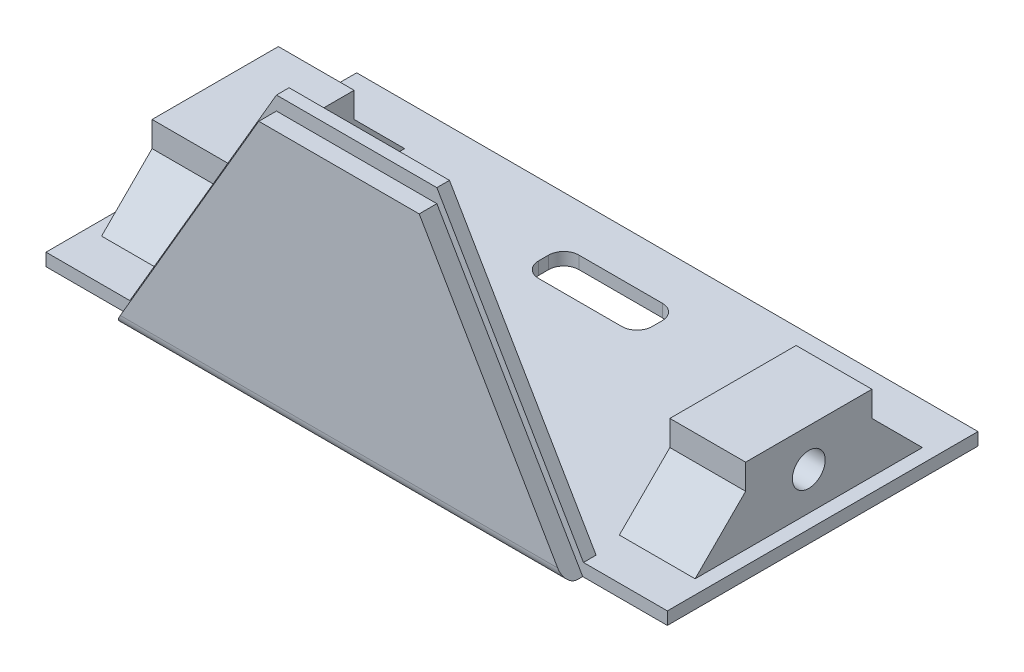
ISO-10303-21;
HEADER;
FILE_DESCRIPTION(('STEP AP214'),'2;1');
FILE_NAME('part.step','',(''),(''),'','','');
FILE_SCHEMA(('AUTOMOTIVE_DESIGN { 1 0 10303 214 1 1 1 1 }'));
ENDSEC;
DATA;
#1=APPLICATION_CONTEXT('core data for automotive mechanical design processes');
#2=APPLICATION_PROTOCOL_DEFINITION('international standard','automotive_design',2000,#1);
#3=PRODUCT_CONTEXT('',#1,'mechanical');
#4=PRODUCT('Part','Part','',(#3));
#5=PRODUCT_RELATED_PRODUCT_CATEGORY('part','',(#4));
#6=PRODUCT_DEFINITION_FORMATION('','',#4);
#7=PRODUCT_DEFINITION_CONTEXT('part definition',#1,'design');
#8=PRODUCT_DEFINITION('design','',#6,#7);
#9=PRODUCT_DEFINITION_SHAPE('','',#8);
#10=(LENGTH_UNIT() NAMED_UNIT(*) SI_UNIT(.MILLI.,.METRE.));
#11=(NAMED_UNIT(*) PLANE_ANGLE_UNIT() SI_UNIT($,.RADIAN.));
#12=(NAMED_UNIT(*) SI_UNIT($,.STERADIAN.) SOLID_ANGLE_UNIT());
#13=UNCERTAINTY_MEASURE_WITH_UNIT(LENGTH_MEASURE(1.E-05),#10,'distance_accuracy_value','');
#14=(GEOMETRIC_REPRESENTATION_CONTEXT(3) GLOBAL_UNCERTAINTY_ASSIGNED_CONTEXT((#13)) GLOBAL_UNIT_ASSIGNED_CONTEXT((#10,
#11,#12)) REPRESENTATION_CONTEXT('',''));
#15=CARTESIAN_POINT('',(0.,0.,0.));
#16=DIRECTION('',(0.,0.,1.));
#17=DIRECTION('',(1.,0.,0.));
#18=AXIS2_PLACEMENT_3D('',#15,#16,#17);
#19=CARTESIAN_POINT('',(0.,1.,0.));
#20=DIRECTION('',(0.,-1.,0.));
#21=DIRECTION('',(0.,0.,-1.));
#22=AXIS2_PLACEMENT_3D('',#19,#20,#21);
#23=PLANE('',#22);
#24=DIRECTION('',(-1.,0.,0.));
#25=VECTOR('',#24,1.);
#26=CARTESIAN_POINT('',(3.3,1.,-8.6));
#27=LINE('',#26,#25);
#28=CARTESIAN_POINT('',(3.3,1.,-8.6));
#29=VERTEX_POINT('',#28);
#30=CARTESIAN_POINT('',(-3.3,1.,-8.6));
#31=VERTEX_POINT('',#30);
#32=EDGE_CURVE('E1223',#29,#31,#27,.T.);
#33=ORIENTED_EDGE('',*,*,#32,.F.);
#34=CARTESIAN_POINT('',(3.3,1.,-7.4));
#35=DIRECTION('',(0.,-1.,0.));
#36=DIRECTION('',(0.,0.,-1.));
#37=AXIS2_PLACEMENT_3D('',#34,#35,#36);
#38=CIRCLE('',#37,1.2);
#39=CARTESIAN_POINT('',(4.5,1.,-7.4));
#40=VERTEX_POINT('',#39);
#41=EDGE_CURVE('E341',#40,#29,#38,.F.);
#42=ORIENTED_EDGE('',*,*,#41,.F.);
#43=DIRECTION('',(0.,0.,-1.));
#44=VECTOR('',#43,1.);
#45=CARTESIAN_POINT('',(4.5,1.,-6.6));
#46=LINE('',#45,#44);
#47=CARTESIAN_POINT('',(4.5,1.,-6.6));
#48=VERTEX_POINT('',#47);
#49=EDGE_CURVE('E338',#48,#40,#46,.T.);
#50=ORIENTED_EDGE('',*,*,#49,.F.);
#51=CARTESIAN_POINT('',(3.3,1.,-6.6));
#52=DIRECTION('',(0.,-1.,0.));
#53=DIRECTION('',(0.,0.,-1.));
#54=AXIS2_PLACEMENT_3D('',#51,#52,#53);
#55=CIRCLE('',#54,1.2);
#56=CARTESIAN_POINT('',(3.3,1.,-5.4));
#57=VERTEX_POINT('',#56);
#58=EDGE_CURVE('E295',#57,#48,#55,.F.);
#59=ORIENTED_EDGE('',*,*,#58,.F.);
#60=DIRECTION('',(1.,0.,0.));
#61=VECTOR('',#60,1.);
#62=CARTESIAN_POINT('',(3.3,1.,-5.4));
#63=LINE('',#62,#61);
#64=CARTESIAN_POINT('',(-3.3,1.,-5.4));
#65=VERTEX_POINT('',#64);
#66=EDGE_CURVE('E1211',#65,#57,#63,.T.);
#67=ORIENTED_EDGE('',*,*,#66,.F.);
#68=CARTESIAN_POINT('',(-3.3,1.,-6.6));
#69=DIRECTION('',(0.,-1.,0.));
#70=DIRECTION('',(0.,0.,-1.));
#71=AXIS2_PLACEMENT_3D('',#68,#69,#70);
#72=CIRCLE('',#71,1.2);
#73=CARTESIAN_POINT('',(-4.5,1.,-6.6));
#74=VERTEX_POINT('',#73);
#75=EDGE_CURVE('E1213',#74,#65,#72,.F.);
#76=ORIENTED_EDGE('',*,*,#75,.F.);
#77=DIRECTION('',(0.,0.,1.));
#78=VECTOR('',#77,1.);
#79=CARTESIAN_POINT('',(-4.5,1.,-6.6));
#80=LINE('',#79,#78);
#81=CARTESIAN_POINT('',(-4.5,1.,-7.4));
#82=VERTEX_POINT('',#81);
#83=EDGE_CURVE('E1219',#82,#74,#80,.T.);
#84=ORIENTED_EDGE('',*,*,#83,.F.);
#85=CARTESIAN_POINT('',(-3.3,1.,-7.4));
#86=DIRECTION('',(0.,-1.,0.));
#87=DIRECTION('',(0.,0.,-1.));
#88=AXIS2_PLACEMENT_3D('',#85,#86,#87);
#89=CIRCLE('',#88,1.2);
#90=EDGE_CURVE('E1221',#31,#82,#89,.F.);
#91=ORIENTED_EDGE('',*,*,#90,.F.);
#92=EDGE_LOOP('',(#33,#42,#50,#59,#67,#76,#84,#91));
#93=FACE_BOUND('',#92,.T.);
#94=DIRECTION('',(1.,0.,0.));
#95=VECTOR('',#94,1.);
#96=CARTESIAN_POINT('',(0.,1.,-8.99999999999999));
#97=LINE('',#96,#95);
#98=CARTESIAN_POINT('',(17.5,1.,-8.99999999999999));
#99=VERTEX_POINT('',#98);
#100=CARTESIAN_POINT('',(23.5,1.,-8.99999999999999));
#101=VERTEX_POINT('',#100);
#102=EDGE_CURVE('E560',#99,#101,#97,.T.);
#103=ORIENTED_EDGE('',*,*,#102,.T.);
#104=DIRECTION('',(0.,0.,1.));
#105=VECTOR('',#104,1.);
#106=CARTESIAN_POINT('',(23.5,1.,-5.));
#107=LINE('',#106,#105);
#108=CARTESIAN_POINT('',(23.5,1.,8.99999999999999));
#109=VERTEX_POINT('',#108);
#110=EDGE_CURVE('E347',#101,#109,#107,.T.);
#111=ORIENTED_EDGE('',*,*,#110,.T.);
#112=DIRECTION('',(-1.,0.,0.));
#113=VECTOR('',#112,1.);
#114=CARTESIAN_POINT('',(0.,1.,8.99999999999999));
#115=LINE('',#114,#113);
#116=CARTESIAN_POINT('',(17.5,1.,8.99999999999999));
#117=VERTEX_POINT('',#116);
#118=EDGE_CURVE('E557',#109,#117,#115,.T.);
#119=ORIENTED_EDGE('',*,*,#118,.T.);
#120=DIRECTION('',(0.,0.,-1.));
#121=VECTOR('',#120,1.);
#122=CARTESIAN_POINT('',(17.5,1.,-5.));
#123=LINE('',#122,#121);
#124=EDGE_CURVE('E352',#117,#99,#123,.T.);
#125=ORIENTED_EDGE('',*,*,#124,.T.);
#126=EDGE_LOOP('',(#103,#111,#119,#125));
#127=FACE_BOUND('',#126,.T.);
#128=DIRECTION('',(-1.,0.,0.));
#129=VECTOR('',#128,1.);
#130=CARTESIAN_POINT('',(-4.5,1.,6.3));
#131=LINE('',#130,#129);
#132=CARTESIAN_POINT('',(-4.5,1.,6.3));
#133=VERTEX_POINT('',#132);
#134=CARTESIAN_POINT('',(-5.5,1.,6.3));
#135=VERTEX_POINT('',#134);
#136=EDGE_CURVE('E423',#133,#135,#131,.T.);
#137=ORIENTED_EDGE('',*,*,#136,.F.);
#138=DIRECTION('',(0.,0.,-1.));
#139=VECTOR('',#138,1.);
#140=CARTESIAN_POINT('',(-4.5,1.,11.3));
#141=LINE('',#140,#139);
#142=CARTESIAN_POINT('',(-4.5,1.,11.3));
#143=VERTEX_POINT('',#142);
#144=EDGE_CURVE('E415',#143,#133,#141,.T.);
#145=ORIENTED_EDGE('',*,*,#144,.F.);
#146=DIRECTION('',(-1.,0.,0.));
#147=VECTOR('',#146,1.);
#148=CARTESIAN_POINT('',(-17.9583333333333,1.,11.3));
#149=LINE('',#148,#147);
#150=CARTESIAN_POINT('',(4.5,1.,11.3));
#151=VERTEX_POINT('',#150);
#152=EDGE_CURVE('E457',#151,#143,#149,.T.);
#153=ORIENTED_EDGE('',*,*,#152,.F.);
#154=DIRECTION('',(0.,0.,-1.));
#155=VECTOR('',#154,1.);
#156=CARTESIAN_POINT('',(4.5,1.,11.3));
#157=LINE('',#156,#155);
#158=CARTESIAN_POINT('',(4.5,1.,6.3));
#159=VERTEX_POINT('',#158);
#160=EDGE_CURVE('E434',#151,#159,#157,.T.);
#161=ORIENTED_EDGE('',*,*,#160,.T.);
#162=DIRECTION('',(1.,0.,0.));
#163=VECTOR('',#162,1.);
#164=CARTESIAN_POINT('',(4.5,1.,6.3));
#165=LINE('',#164,#163);
#166=CARTESIAN_POINT('',(5.5,1.,6.3));
#167=VERTEX_POINT('',#166);
#168=EDGE_CURVE('E442',#159,#167,#165,.T.);
#169=ORIENTED_EDGE('',*,*,#168,.T.);
#170=DIRECTION('',(0.,0.,-1.));
#171=VECTOR('',#170,1.);
#172=CARTESIAN_POINT('',(5.5,1.,11.3));
#173=LINE('',#172,#171);
#174=CARTESIAN_POINT('',(5.5,1.,11.3));
#175=VERTEX_POINT('',#174);
#176=EDGE_CURVE('E425',#175,#167,#173,.T.);
#177=ORIENTED_EDGE('',*,*,#176,.F.);
#178=CARTESIAN_POINT('',(17.9583333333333,1.,11.3));
#179=VERTEX_POINT('',#178);
#180=EDGE_CURVE('E453',#179,#175,#149,.T.);
#181=ORIENTED_EDGE('',*,*,#180,.F.);
#182=DIRECTION('',(0.,0.,1.));
#183=VECTOR('',#182,1.);
#184=CARTESIAN_POINT('',(17.9583333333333,1.,11.3));
#185=LINE('',#184,#183);
#186=CARTESIAN_POINT('',(17.9583333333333,1.,12.3));
#187=VERTEX_POINT('',#186);
#188=EDGE_CURVE('E473',#179,#187,#185,.T.);
#189=ORIENTED_EDGE('',*,*,#188,.T.);
#190=DIRECTION('',(1.,0.,0.));
#191=VECTOR('',#190,1.);
#192=CARTESIAN_POINT('',(24.6,1.,12.3));
#193=LINE('',#192,#191);
#194=CARTESIAN_POINT('',(24.6,1.,12.3));
#195=VERTEX_POINT('',#194);
#196=EDGE_CURVE('E507',#187,#195,#193,.T.);
#197=ORIENTED_EDGE('',*,*,#196,.T.);
#198=DIRECTION('',(0.,0.,-1.));
#199=VECTOR('',#198,1.);
#200=CARTESIAN_POINT('',(24.6,1.,-12.3));
#201=LINE('',#200,#199);
#202=CARTESIAN_POINT('',(24.6,1.,-12.3));
#203=VERTEX_POINT('',#202);
#204=EDGE_CURVE('E512',#195,#203,#201,.T.);
#205=ORIENTED_EDGE('',*,*,#204,.T.);
#206=DIRECTION('',(-1.,0.,0.));
#207=VECTOR('',#206,1.);
#208=CARTESIAN_POINT('',(24.6,1.,-12.3));
#209=LINE('',#208,#207);
#210=CARTESIAN_POINT('',(-24.6,1.,-12.3));
#211=VERTEX_POINT('',#210);
#212=EDGE_CURVE('E514',#203,#211,#209,.T.);
#213=ORIENTED_EDGE('',*,*,#212,.T.);
#214=DIRECTION('',(0.,0.,1.));
#215=VECTOR('',#214,1.);
#216=CARTESIAN_POINT('',(-24.6,1.,-12.3));
#217=LINE('',#216,#215);
#218=CARTESIAN_POINT('',(-24.6,1.,12.3));
#219=VERTEX_POINT('',#218);
#220=EDGE_CURVE('E504',#211,#219,#217,.T.);
#221=ORIENTED_EDGE('',*,*,#220,.T.);
#222=CARTESIAN_POINT('',(-17.9583333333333,1.,12.3));
#223=VERTEX_POINT('',#222);
#224=EDGE_CURVE('E509',#219,#223,#193,.T.);
#225=ORIENTED_EDGE('',*,*,#224,.T.);
#226=DIRECTION('',(0.,0.,1.));
#227=VECTOR('',#226,1.);
#228=CARTESIAN_POINT('',(-17.9583333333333,1.,11.3));
#229=LINE('',#228,#227);
#230=CARTESIAN_POINT('',(-17.9583333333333,1.,11.3));
#231=VERTEX_POINT('',#230);
#232=EDGE_CURVE('E471',#231,#223,#229,.T.);
#233=ORIENTED_EDGE('',*,*,#232,.F.);
#234=CARTESIAN_POINT('',(-5.5,1.,11.3));
#235=VERTEX_POINT('',#234);
#236=EDGE_CURVE('E451',#235,#231,#149,.T.);
#237=ORIENTED_EDGE('',*,*,#236,.F.);
#238=DIRECTION('',(0.,0.,-1.));
#239=VECTOR('',#238,1.);
#240=CARTESIAN_POINT('',(-5.5,1.,11.3));
#241=LINE('',#240,#239);
#242=EDGE_CURVE('E406',#235,#135,#241,.T.);
#243=ORIENTED_EDGE('',*,*,#242,.T.);
#244=EDGE_LOOP('',(#137,#145,#153,#161,#169,#177,#181,#189,#197,#205,#213,#221,#225,#233,#237,#243));
#245=FACE_BOUND('',#244,.T.);
#246=DIRECTION('',(0.,0.,1.));
#247=VECTOR('',#246,1.);
#248=CARTESIAN_POINT('',(-23.5,1.,-5.));
#249=LINE('',#248,#247);
#250=CARTESIAN_POINT('',(-23.5,1.,-8.99999999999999));
#251=VERTEX_POINT('',#250);
#252=CARTESIAN_POINT('',(-23.5,1.,8.99999999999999));
#253=VERTEX_POINT('',#252);
#254=EDGE_CURVE('E381',#251,#253,#249,.T.);
#255=ORIENTED_EDGE('',*,*,#254,.F.);
#256=DIRECTION('',(1.,0.,0.));
#257=VECTOR('',#256,1.);
#258=CARTESIAN_POINT('',(-17.5,1.,-8.99999999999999));
#259=LINE('',#258,#257);
#260=CARTESIAN_POINT('',(-17.5,1.,-8.99999999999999));
#261=VERTEX_POINT('',#260);
#262=EDGE_CURVE('E541',#251,#261,#259,.T.);
#263=ORIENTED_EDGE('',*,*,#262,.T.);
#264=DIRECTION('',(0.,0.,-1.));
#265=VECTOR('',#264,1.);
#266=CARTESIAN_POINT('',(-17.5,1.,-5.));
#267=LINE('',#266,#265);
#268=CARTESIAN_POINT('',(-17.5,1.,8.99999999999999));
#269=VERTEX_POINT('',#268);
#270=EDGE_CURVE('E386',#269,#261,#267,.T.);
#271=ORIENTED_EDGE('',*,*,#270,.F.);
#272=DIRECTION('',(-1.,0.,0.));
#273=VECTOR('',#272,1.);
#274=CARTESIAN_POINT('',(-23.5,1.,9.));
#275=LINE('',#274,#273);
#276=EDGE_CURVE('E538',#269,#253,#275,.T.);
#277=ORIENTED_EDGE('',*,*,#276,.T.);
#278=EDGE_LOOP('',(#255,#263,#271,#277));
#279=FACE_BOUND('',#278,.T.);
#280=ADVANCED_FACE('F39',(#93,#127,#245,#279),#23,.F.);
#281=CARTESIAN_POINT('',(24.6,1.,12.3));
#282=DIRECTION('',(0.,0.,-1.));
#283=DIRECTION('',(-1.,0.,0.));
#284=AXIS2_PLACEMENT_3D('',#281,#282,#283);
#285=PLANE('',#284);
#286=DIRECTION('',(-0.503871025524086,0.863778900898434,0.));
#287=VECTOR('',#286,1.);
#288=CARTESIAN_POINT('',(17.9,0.,12.3));
#289=LINE('',#288,#287);
#290=CARTESIAN_POINT('',(17.9,0.,12.3));
#291=VERTEX_POINT('',#290);
#292=CARTESIAN_POINT('',(6.35,19.8,12.3));
#293=VERTEX_POINT('',#292);
#294=EDGE_CURVE('E476',#291,#293,#289,.T.);
#295=ORIENTED_EDGE('',*,*,#294,.F.);
#296=DIRECTION('',(1.,0.,0.));
#297=VECTOR('',#296,1.);
#298=CARTESIAN_POINT('',(24.6,0.,12.3));
#299=LINE('',#298,#297);
#300=CARTESIAN_POINT('',(24.6,0.,12.3));
#301=VERTEX_POINT('',#300);
#302=EDGE_CURVE('E519',#291,#301,#299,.T.);
#303=ORIENTED_EDGE('',*,*,#302,.T.);
#304=DIRECTION('',(0.,-1.,0.));
#305=VECTOR('',#304,1.);
#306=CARTESIAN_POINT('',(24.6,1.,12.3));
#307=LINE('',#306,#305);
#308=EDGE_CURVE('E531',#195,#301,#307,.T.);
#309=ORIENTED_EDGE('',*,*,#308,.F.);
#310=ORIENTED_EDGE('',*,*,#196,.F.);
#311=DIRECTION('',(0.503871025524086,-0.863778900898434,0.));
#312=VECTOR('',#311,1.);
#313=CARTESIAN_POINT('',(6.35,20.9,12.3));
#314=LINE('',#313,#312);
#315=CARTESIAN_POINT('',(6.35,20.9,12.3));
#316=VERTEX_POINT('',#315);
#317=EDGE_CURVE('E446',#316,#187,#314,.T.);
#318=ORIENTED_EDGE('',*,*,#317,.F.);
#319=DIRECTION('',(1.,0.,0.));
#320=VECTOR('',#319,1.);
#321=CARTESIAN_POINT('',(-6.35,20.9,12.3));
#322=LINE('',#321,#320);
#323=CARTESIAN_POINT('',(-6.35,20.9,12.3));
#324=VERTEX_POINT('',#323);
#325=EDGE_CURVE('E452',#324,#316,#322,.T.);
#326=ORIENTED_EDGE('',*,*,#325,.F.);
#327=DIRECTION('',(0.503871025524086,0.863778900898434,0.));
#328=VECTOR('',#327,1.);
#329=CARTESIAN_POINT('',(-6.35,20.9,12.3));
#330=LINE('',#329,#328);
#331=EDGE_CURVE('E463',#223,#324,#330,.T.);
#332=ORIENTED_EDGE('',*,*,#331,.F.);
#333=ORIENTED_EDGE('',*,*,#224,.F.);
#334=DIRECTION('',(0.,-1.,0.));
#335=VECTOR('',#334,1.);
#336=CARTESIAN_POINT('',(-24.6,1.,12.3));
#337=LINE('',#336,#335);
#338=CARTESIAN_POINT('',(-24.6,0.,12.3));
#339=VERTEX_POINT('',#338);
#340=EDGE_CURVE('E490',#219,#339,#337,.T.);
#341=ORIENTED_EDGE('',*,*,#340,.T.);
#342=CARTESIAN_POINT('',(-17.9,0.,12.3));
#343=VERTEX_POINT('',#342);
#344=EDGE_CURVE('E520',#339,#343,#299,.T.);
#345=ORIENTED_EDGE('',*,*,#344,.T.);
#346=DIRECTION('',(-0.503871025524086,-0.863778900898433,0.));
#347=VECTOR('',#346,1.);
#348=CARTESIAN_POINT('',(-17.9,0.,12.3));
#349=LINE('',#348,#347);
#350=CARTESIAN_POINT('',(-6.35,19.8,12.3));
#351=VERTEX_POINT('',#350);
#352=EDGE_CURVE('E486',#351,#343,#349,.T.);
#353=ORIENTED_EDGE('',*,*,#352,.F.);
#354=DIRECTION('',(-1.,0.,0.));
#355=VECTOR('',#354,1.);
#356=CARTESIAN_POINT('',(-6.35,19.8,12.3));
#357=LINE('',#356,#355);
#358=EDGE_CURVE('E481',#293,#351,#357,.T.);
#359=ORIENTED_EDGE('',*,*,#358,.F.);
#360=EDGE_LOOP('',(#295,#303,#309,#310,#318,#326,#332,#333,#341,#345,#353,#359));
#361=FACE_BOUND('',#360,.T.);
#362=ADVANCED_FACE('F604',(#361),#285,.F.);
#363=CARTESIAN_POINT('',(-24.6,1.,-12.3));
#364=DIRECTION('',(1.,0.,0.));
#365=DIRECTION('',(0.,0.,-1.));
#366=AXIS2_PLACEMENT_3D('',#363,#364,#365);
#367=PLANE('',#366);
#368=DIRECTION('',(0.,0.,1.));
#369=VECTOR('',#368,1.);
#370=CARTESIAN_POINT('',(-24.6,0.,-12.3));
#371=LINE('',#370,#369);
#372=CARTESIAN_POINT('',(-24.6,0.,-12.3));
#373=VERTEX_POINT('',#372);
#374=EDGE_CURVE('E503',#373,#339,#371,.T.);
#375=ORIENTED_EDGE('',*,*,#374,.T.);
#376=ORIENTED_EDGE('',*,*,#340,.F.);
#377=ORIENTED_EDGE('',*,*,#220,.F.);
#378=DIRECTION('',(0.,-1.,0.));
#379=VECTOR('',#378,1.);
#380=CARTESIAN_POINT('',(-24.6,1.,-12.3));
#381=LINE('',#380,#379);
#382=EDGE_CURVE('E516',#211,#373,#381,.T.);
#383=ORIENTED_EDGE('',*,*,#382,.T.);
#384=EDGE_LOOP('',(#375,#376,#377,#383));
#385=FACE_BOUND('',#384,.T.);
#386=ADVANCED_FACE('F610',(#385),#367,.F.);
#387=CARTESIAN_POINT('',(24.6,1.,-12.3));
#388=DIRECTION('',(-1.,0.,0.));
#389=DIRECTION('',(0.,0.,1.));
#390=AXIS2_PLACEMENT_3D('',#387,#388,#389);
#391=PLANE('',#390);
#392=DIRECTION('',(0.,0.,-1.));
#393=VECTOR('',#392,1.);
#394=CARTESIAN_POINT('',(24.6,0.,-12.3));
#395=LINE('',#394,#393);
#396=CARTESIAN_POINT('',(24.6,0.,-12.3));
#397=VERTEX_POINT('',#396);
#398=EDGE_CURVE('E523',#301,#397,#395,.T.);
#399=ORIENTED_EDGE('',*,*,#398,.T.);
#400=DIRECTION('',(0.,-1.,0.));
#401=VECTOR('',#400,1.);
#402=CARTESIAN_POINT('',(24.6,1.,-12.3));
#403=LINE('',#402,#401);
#404=EDGE_CURVE('E528',#203,#397,#403,.T.);
#405=ORIENTED_EDGE('',*,*,#404,.F.);
#406=ORIENTED_EDGE('',*,*,#204,.F.);
#407=ORIENTED_EDGE('',*,*,#308,.T.);
#408=EDGE_LOOP('',(#399,#405,#406,#407));
#409=FACE_BOUND('',#408,.T.);
#410=ADVANCED_FACE('F619',(#409),#391,.F.);
#411=CARTESIAN_POINT('',(24.6,1.,-12.3));
#412=DIRECTION('',(0.,0.,1.));
#413=DIRECTION('',(1.,0.,0.));
#414=AXIS2_PLACEMENT_3D('',#411,#412,#413);
#415=PLANE('',#414);
#416=DIRECTION('',(-1.,0.,0.));
#417=VECTOR('',#416,1.);
#418=CARTESIAN_POINT('',(24.6,0.,-12.3));
#419=LINE('',#418,#417);
#420=EDGE_CURVE('E508',#397,#373,#419,.T.);
#421=ORIENTED_EDGE('',*,*,#420,.T.);
#422=ORIENTED_EDGE('',*,*,#382,.F.);
#423=ORIENTED_EDGE('',*,*,#212,.F.);
#424=ORIENTED_EDGE('',*,*,#404,.T.);
#425=EDGE_LOOP('',(#421,#422,#423,#424));
#426=FACE_BOUND('',#425,.T.);
#427=ADVANCED_FACE('F615',(#426),#415,.F.);
#428=CARTESIAN_POINT('',(0.,0.,0.));
#429=DIRECTION('',(0.,-1.,0.));
#430=DIRECTION('',(0.,0.,-1.));
#431=AXIS2_PLACEMENT_3D('',#428,#429,#430);
#432=PLANE('',#431);
#433=CARTESIAN_POINT('',(3.3,0.,-7.4));
#434=DIRECTION('',(0.,-1.,0.));
#435=DIRECTION('',(0.,0.,1.));
#436=AXIS2_PLACEMENT_3D('',#433,#434,#435);
#437=CIRCLE('',#436,1.2);
#438=CARTESIAN_POINT('',(3.3,0.,-8.6));
#439=VERTEX_POINT('',#438);
#440=CARTESIAN_POINT('',(4.5,0.,-7.4));
#441=VERTEX_POINT('',#440);
#442=EDGE_CURVE('E62',#439,#441,#437,.T.);
#443=ORIENTED_EDGE('',*,*,#442,.F.);
#444=DIRECTION('',(1.,0.,0.));
#445=VECTOR('',#444,1.);
#446=CARTESIAN_POINT('',(3.3,0.,-8.6));
#447=LINE('',#446,#445);
#448=CARTESIAN_POINT('',(-3.3,0.,-8.6));
#449=VERTEX_POINT('',#448);
#450=EDGE_CURVE('E323',#449,#439,#447,.T.);
#451=ORIENTED_EDGE('',*,*,#450,.F.);
#452=CARTESIAN_POINT('',(-3.3,0.,-7.4));
#453=DIRECTION('',(0.,-1.,0.));
#454=DIRECTION('',(0.,0.,1.));
#455=AXIS2_PLACEMENT_3D('',#452,#453,#454);
#456=CIRCLE('',#455,1.2);
#457=CARTESIAN_POINT('',(-4.5,0.,-7.4));
#458=VERTEX_POINT('',#457);
#459=EDGE_CURVE('E320',#458,#449,#456,.T.);
#460=ORIENTED_EDGE('',*,*,#459,.F.);
#461=DIRECTION('',(0.,0.,-1.));
#462=VECTOR('',#461,1.);
#463=CARTESIAN_POINT('',(-4.5,0.,-6.6));
#464=LINE('',#463,#462);
#465=CARTESIAN_POINT('',(-4.5,0.,-6.6));
#466=VERTEX_POINT('',#465);
#467=EDGE_CURVE('E317',#466,#458,#464,.T.);
#468=ORIENTED_EDGE('',*,*,#467,.F.);
#469=CARTESIAN_POINT('',(-3.3,0.,-6.6));
#470=DIRECTION('',(0.,-1.,0.));
#471=DIRECTION('',(0.,0.,-1.));
#472=AXIS2_PLACEMENT_3D('',#469,#470,#471);
#473=CIRCLE('',#472,1.2);
#474=CARTESIAN_POINT('',(-3.3,0.,-5.4));
#475=VERTEX_POINT('',#474);
#476=EDGE_CURVE('E311',#475,#466,#473,.T.);
#477=ORIENTED_EDGE('',*,*,#476,.F.);
#478=DIRECTION('',(-1.,0.,0.));
#479=VECTOR('',#478,1.);
#480=CARTESIAN_POINT('',(3.3,0.,-5.4));
#481=LINE('',#480,#479);
#482=CARTESIAN_POINT('',(3.3,0.,-5.4));
#483=VERTEX_POINT('',#482);
#484=EDGE_CURVE('E309',#483,#475,#481,.T.);
#485=ORIENTED_EDGE('',*,*,#484,.F.);
#486=CARTESIAN_POINT('',(3.3,0.,-6.6));
#487=DIRECTION('',(0.,-1.,0.));
#488=DIRECTION('',(0.,0.,1.));
#489=AXIS2_PLACEMENT_3D('',#486,#487,#488);
#490=CIRCLE('',#489,1.2);
#491=CARTESIAN_POINT('',(4.5,0.,-6.6));
#492=VERTEX_POINT('',#491);
#493=EDGE_CURVE('E292',#492,#483,#490,.T.);
#494=ORIENTED_EDGE('',*,*,#493,.F.);
#495=DIRECTION('',(0.,0.,1.));
#496=VECTOR('',#495,1.);
#497=CARTESIAN_POINT('',(4.5,0.,-6.6));
#498=LINE('',#497,#496);
#499=EDGE_CURVE('E301',#441,#492,#498,.T.);
#500=ORIENTED_EDGE('',*,*,#499,.F.);
#501=EDGE_LOOP('',(#443,#451,#460,#468,#477,#485,#494,#500));
#502=FACE_BOUND('',#501,.T.);
#503=DIRECTION('',(0.,0.,-1.));
#504=VECTOR('',#503,1.);
#505=CARTESIAN_POINT('',(17.9,0.,13.7));
#506=LINE('',#505,#504);
#507=CARTESIAN_POINT('',(17.9,0.,12.7));
#508=VERTEX_POINT('',#507);
#509=EDGE_CURVE('E499',#508,#291,#506,.T.);
#510=ORIENTED_EDGE('',*,*,#509,.F.);
#511=DIRECTION('',(1.,0.,0.));
#512=VECTOR('',#511,1.);
#513=CARTESIAN_POINT('',(0.,0.,12.7));
#514=LINE('',#513,#512);
#515=CARTESIAN_POINT('',(-17.9,0.,12.7));
#516=VERTEX_POINT('',#515);
#517=EDGE_CURVE('E47',#508,#516,#514,.F.);
#518=ORIENTED_EDGE('',*,*,#517,.T.);
#519=DIRECTION('',(0.,0.,-1.));
#520=VECTOR('',#519,1.);
#521=CARTESIAN_POINT('',(-17.9,0.,13.7));
#522=LINE('',#521,#520);
#523=EDGE_CURVE('E501',#516,#343,#522,.T.);
#524=ORIENTED_EDGE('',*,*,#523,.T.);
#525=ORIENTED_EDGE('',*,*,#344,.F.);
#526=ORIENTED_EDGE('',*,*,#374,.F.);
#527=ORIENTED_EDGE('',*,*,#420,.F.);
#528=ORIENTED_EDGE('',*,*,#398,.F.);
#529=ORIENTED_EDGE('',*,*,#302,.F.);
#530=EDGE_LOOP('',(#510,#518,#524,#525,#526,#527,#528,#529));
#531=FACE_BOUND('',#530,.T.);
#532=ADVANCED_FACE('F305',(#502,#531),#432,.T.);
#533=CARTESIAN_POINT('',(-17.9,0.,13.7));
#534=DIRECTION('',(0.863778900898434,-0.503871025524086,0.));
#535=DIRECTION('',(0.503871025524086,0.863778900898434,0.));
#536=AXIS2_PLACEMENT_3D('',#533,#534,#535);
#537=PLANE('',#536);
#538=ORIENTED_EDGE('',*,*,#523,.F.);
#539=CARTESIAN_POINT('',(-17.3166666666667,1.,12.7));
#540=DIRECTION('',(0.863778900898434,-0.503871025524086,0.));
#541=DIRECTION('',(0.503871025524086,0.863778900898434,0.));
#542=AXIS2_PLACEMENT_3D('',#539,#540,#541);
#543=ELLIPSE('',#542,1.15770366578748,1.);
#544=CARTESIAN_POINT('',(-17.3166666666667,1.,13.7));
#545=VERTEX_POINT('',#544);
#546=EDGE_CURVE('E11',#516,#545,#543,.F.);
#547=ORIENTED_EDGE('',*,*,#546,.T.);
#548=DIRECTION('',(-0.503871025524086,-0.863778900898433,0.));
#549=VECTOR('',#548,1.);
#550=CARTESIAN_POINT('',(-17.9,0.,13.7));
#551=LINE('',#550,#549);
#552=CARTESIAN_POINT('',(-6.35,19.8,13.7));
#553=VERTEX_POINT('',#552);
#554=EDGE_CURVE('E477',#553,#545,#551,.T.);
#555=ORIENTED_EDGE('',*,*,#554,.F.);
#556=DIRECTION('',(0.,0.,-1.));
#557=VECTOR('',#556,1.);
#558=CARTESIAN_POINT('',(-6.35,19.8,13.7));
#559=LINE('',#558,#557);
#560=EDGE_CURVE('E485',#553,#351,#559,.T.);
#561=ORIENTED_EDGE('',*,*,#560,.T.);
#562=ORIENTED_EDGE('',*,*,#352,.T.);
#563=EDGE_LOOP('',(#538,#547,#555,#561,#562));
#564=FACE_BOUND('',#563,.T.);
#565=ADVANCED_FACE('F588',(#564),#537,.F.);
#566=CARTESIAN_POINT('',(17.9,0.,13.7));
#567=DIRECTION('',(-0.863778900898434,-0.503871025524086,0.));
#568=DIRECTION('',(0.503871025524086,-0.863778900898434,0.));
#569=AXIS2_PLACEMENT_3D('',#566,#567,#568);
#570=PLANE('',#569);
#571=DIRECTION('',(-0.503871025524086,0.863778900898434,0.));
#572=VECTOR('',#571,1.);
#573=CARTESIAN_POINT('',(17.9,0.,13.7));
#574=LINE('',#573,#572);
#575=CARTESIAN_POINT('',(17.3166666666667,0.999999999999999,13.7));
#576=VERTEX_POINT('',#575);
#577=CARTESIAN_POINT('',(6.35,19.8,13.7));
#578=VERTEX_POINT('',#577);
#579=EDGE_CURVE('E480',#576,#578,#574,.T.);
#580=ORIENTED_EDGE('',*,*,#579,.F.);
#581=CARTESIAN_POINT('',(17.3166666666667,1.,12.7));
#582=DIRECTION('',(-0.863778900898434,-0.503871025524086,0.));
#583=DIRECTION('',(0.503871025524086,-0.863778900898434,0.));
#584=AXIS2_PLACEMENT_3D('',#581,#582,#583);
#585=ELLIPSE('',#584,1.15770366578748,1.);
#586=EDGE_CURVE('E580',#576,#508,#585,.F.);
#587=ORIENTED_EDGE('',*,*,#586,.T.);
#588=ORIENTED_EDGE('',*,*,#509,.T.);
#589=ORIENTED_EDGE('',*,*,#294,.T.);
#590=DIRECTION('',(0.,0.,-1.));
#591=VECTOR('',#590,1.);
#592=CARTESIAN_POINT('',(6.35,19.8,13.7));
#593=LINE('',#592,#591);
#594=EDGE_CURVE('E496',#578,#293,#593,.T.);
#595=ORIENTED_EDGE('',*,*,#594,.F.);
#596=EDGE_LOOP('',(#580,#587,#588,#589,#595));
#597=FACE_BOUND('',#596,.T.);
#598=ADVANCED_FACE('F596',(#597),#570,.F.);
#599=CARTESIAN_POINT('',(-6.35,19.8,13.7));
#600=DIRECTION('',(0.,-1.,0.));
#601=DIRECTION('',(0.,0.,-1.));
#602=AXIS2_PLACEMENT_3D('',#599,#600,#601);
#603=PLANE('',#602);
#604=ORIENTED_EDGE('',*,*,#358,.T.);
#605=ORIENTED_EDGE('',*,*,#560,.F.);
#606=DIRECTION('',(-1.,0.,0.));
#607=VECTOR('',#606,1.);
#608=CARTESIAN_POINT('',(-6.35,19.8,13.7));
#609=LINE('',#608,#607);
#610=EDGE_CURVE('E483',#578,#553,#609,.T.);
#611=ORIENTED_EDGE('',*,*,#610,.F.);
#612=ORIENTED_EDGE('',*,*,#594,.T.);
#613=EDGE_LOOP('',(#604,#605,#611,#612));
#614=FACE_BOUND('',#613,.T.);
#615=ADVANCED_FACE('F602',(#614),#603,.F.);
#616=CARTESIAN_POINT('',(0.,0.,13.7));
#617=DIRECTION('',(0.,0.,1.));
#618=DIRECTION('',(1.,0.,0.));
#619=AXIS2_PLACEMENT_3D('',#616,#617,#618);
#620=PLANE('',#619);
#621=ORIENTED_EDGE('',*,*,#554,.T.);
#622=DIRECTION('',(1.,0.,0.));
#623=VECTOR('',#622,1.);
#624=CARTESIAN_POINT('',(0.,1.,13.7));
#625=LINE('',#624,#623);
#626=EDGE_CURVE('E577',#545,#576,#625,.T.);
#627=ORIENTED_EDGE('',*,*,#626,.T.);
#628=ORIENTED_EDGE('',*,*,#579,.T.);
#629=ORIENTED_EDGE('',*,*,#610,.T.);
#630=EDGE_LOOP('',(#621,#627,#628,#629));
#631=FACE_BOUND('',#630,.T.);
#632=ADVANCED_FACE('F593',(#631),#620,.T.);
#633=CARTESIAN_POINT('',(6.35,20.9,11.3));
#634=DIRECTION('',(-0.863778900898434,-0.503871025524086,0.));
#635=DIRECTION('',(0.503871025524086,-0.863778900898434,0.));
#636=AXIS2_PLACEMENT_3D('',#633,#634,#635);
#637=PLANE('',#636);
#638=ORIENTED_EDGE('',*,*,#317,.T.);
#639=ORIENTED_EDGE('',*,*,#188,.F.);
#640=DIRECTION('',(0.503871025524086,-0.863778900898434,0.));
#641=VECTOR('',#640,1.);
#642=CARTESIAN_POINT('',(6.35,20.9,11.3));
#643=LINE('',#642,#641);
#644=CARTESIAN_POINT('',(6.35,20.9,11.3));
#645=VERTEX_POINT('',#644);
#646=EDGE_CURVE('E449',#645,#179,#643,.T.);
#647=ORIENTED_EDGE('',*,*,#646,.F.);
#648=DIRECTION('',(0.,0.,1.));
#649=VECTOR('',#648,1.);
#650=CARTESIAN_POINT('',(6.35,20.9,11.3));
#651=LINE('',#650,#649);
#652=EDGE_CURVE('E461',#645,#316,#651,.T.);
#653=ORIENTED_EDGE('',*,*,#652,.T.);
#654=EDGE_LOOP('',(#638,#639,#647,#653));
#655=FACE_BOUND('',#654,.T.);
#656=ADVANCED_FACE('F632',(#655),#637,.F.);
#657=CARTESIAN_POINT('',(-6.35,20.9,11.3));
#658=DIRECTION('',(0.863778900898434,-0.503871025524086,0.));
#659=DIRECTION('',(0.503871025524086,0.863778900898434,0.));
#660=AXIS2_PLACEMENT_3D('',#657,#658,#659);
#661=PLANE('',#660);
#662=ORIENTED_EDGE('',*,*,#331,.T.);
#663=DIRECTION('',(0.,0.,1.));
#664=VECTOR('',#663,1.);
#665=CARTESIAN_POINT('',(-6.35,20.9,11.3));
#666=LINE('',#665,#664);
#667=CARTESIAN_POINT('',(-6.35,20.9,11.3));
#668=VERTEX_POINT('',#667);
#669=EDGE_CURVE('E468',#668,#324,#666,.T.);
#670=ORIENTED_EDGE('',*,*,#669,.F.);
#671=DIRECTION('',(0.503871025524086,0.863778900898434,0.));
#672=VECTOR('',#671,1.);
#673=CARTESIAN_POINT('',(-6.35,20.9,11.3));
#674=LINE('',#673,#672);
#675=EDGE_CURVE('E456',#231,#668,#674,.T.);
#676=ORIENTED_EDGE('',*,*,#675,.F.);
#677=ORIENTED_EDGE('',*,*,#232,.T.);
#678=EDGE_LOOP('',(#662,#670,#676,#677));
#679=FACE_BOUND('',#678,.T.);
#680=ADVANCED_FACE('F643',(#679),#661,.F.);
#681=CARTESIAN_POINT('',(-6.35,20.9,11.3));
#682=DIRECTION('',(0.,-1.,0.));
#683=DIRECTION('',(0.,0.,-1.));
#684=AXIS2_PLACEMENT_3D('',#681,#682,#683);
#685=PLANE('',#684);
#686=ORIENTED_EDGE('',*,*,#325,.T.);
#687=ORIENTED_EDGE('',*,*,#652,.F.);
#688=DIRECTION('',(1.,0.,0.));
#689=VECTOR('',#688,1.);
#690=CARTESIAN_POINT('',(-6.35,20.9,11.3));
#691=LINE('',#690,#689);
#692=EDGE_CURVE('E459',#668,#645,#691,.T.);
#693=ORIENTED_EDGE('',*,*,#692,.F.);
#694=ORIENTED_EDGE('',*,*,#669,.T.);
#695=EDGE_LOOP('',(#686,#687,#693,#694));
#696=FACE_BOUND('',#695,.T.);
#697=ADVANCED_FACE('F636',(#696),#685,.F.);
#698=CARTESIAN_POINT('',(0.,0.,11.3));
#699=DIRECTION('',(0.,0.,-1.));
#700=DIRECTION('',(-1.,0.,0.));
#701=AXIS2_PLACEMENT_3D('',#698,#699,#700);
#702=PLANE('',#701);
#703=DIRECTION('',(0.,-1.,0.));
#704=VECTOR('',#703,1.);
#705=CARTESIAN_POINT('',(-4.5,15.9,11.3));
#706=LINE('',#705,#704);
#707=CARTESIAN_POINT('',(-4.5,15.9,11.3));
#708=VERTEX_POINT('',#707);
#709=EDGE_CURVE('E418',#708,#143,#706,.T.);
#710=ORIENTED_EDGE('',*,*,#709,.F.);
#711=DIRECTION('',(-1.,0.,0.));
#712=VECTOR('',#711,1.);
#713=CARTESIAN_POINT('',(-4.5,15.9,11.3));
#714=LINE('',#713,#712);
#715=CARTESIAN_POINT('',(-5.5,15.9,11.3));
#716=VERTEX_POINT('',#715);
#717=EDGE_CURVE('E422',#708,#716,#714,.T.);
#718=ORIENTED_EDGE('',*,*,#717,.T.);
#719=DIRECTION('',(0.,-1.,0.));
#720=VECTOR('',#719,1.);
#721=CARTESIAN_POINT('',(-5.5,15.9,11.3));
#722=LINE('',#721,#720);
#723=EDGE_CURVE('E409',#716,#235,#722,.T.);
#724=ORIENTED_EDGE('',*,*,#723,.T.);
#725=ORIENTED_EDGE('',*,*,#236,.T.);
#726=ORIENTED_EDGE('',*,*,#675,.T.);
#727=ORIENTED_EDGE('',*,*,#692,.T.);
#728=ORIENTED_EDGE('',*,*,#646,.T.);
#729=ORIENTED_EDGE('',*,*,#180,.T.);
#730=DIRECTION('',(0.,-1.,0.));
#731=VECTOR('',#730,1.);
#732=CARTESIAN_POINT('',(5.5,15.9,11.3));
#733=LINE('',#732,#731);
#734=CARTESIAN_POINT('',(5.5,15.9,11.3));
#735=VERTEX_POINT('',#734);
#736=EDGE_CURVE('E432',#735,#175,#733,.T.);
#737=ORIENTED_EDGE('',*,*,#736,.F.);
#738=DIRECTION('',(1.,0.,0.));
#739=VECTOR('',#738,1.);
#740=CARTESIAN_POINT('',(4.5,15.9,11.3));
#741=LINE('',#740,#739);
#742=CARTESIAN_POINT('',(4.5,15.9,11.3));
#743=VERTEX_POINT('',#742);
#744=EDGE_CURVE('E443',#743,#735,#741,.T.);
#745=ORIENTED_EDGE('',*,*,#744,.F.);
#746=DIRECTION('',(0.,-1.,0.));
#747=VECTOR('',#746,1.);
#748=CARTESIAN_POINT('',(4.5,15.9,11.3));
#749=LINE('',#748,#747);
#750=EDGE_CURVE('E439',#743,#151,#749,.T.);
#751=ORIENTED_EDGE('',*,*,#750,.T.);
#752=ORIENTED_EDGE('',*,*,#152,.T.);
#753=EDGE_LOOP('',(#710,#718,#724,#725,#726,#727,#728,#729,#737,#745,#751,#752));
#754=FACE_BOUND('',#753,.T.);
#755=ADVANCED_FACE('F646',(#754),#702,.T.);
#756=CARTESIAN_POINT('',(4.5,1.,6.3));
#757=DIRECTION('',(0.,0.318135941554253,-0.948045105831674));
#758=DIRECTION('',(0.,0.948045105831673,0.318135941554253));
#759=AXIS2_PLACEMENT_3D('',#756,#757,#758);
#760=PLANE('',#759);
#761=ORIENTED_EDGE('',*,*,#744,.T.);
#762=DIRECTION('',(0.,0.948045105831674,0.318135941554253));
#763=VECTOR('',#762,1.);
#764=CARTESIAN_POINT('',(5.5,1.,6.3));
#765=LINE('',#764,#763);
#766=EDGE_CURVE('E430',#167,#735,#765,.T.);
#767=ORIENTED_EDGE('',*,*,#766,.F.);
#768=ORIENTED_EDGE('',*,*,#168,.F.);
#769=DIRECTION('',(0.,0.948045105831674,0.318135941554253));
#770=VECTOR('',#769,1.);
#771=CARTESIAN_POINT('',(4.5,1.,6.3));
#772=LINE('',#771,#770);
#773=EDGE_CURVE('E437',#159,#743,#772,.T.);
#774=ORIENTED_EDGE('',*,*,#773,.T.);
#775=EDGE_LOOP('',(#761,#767,#768,#774));
#776=FACE_BOUND('',#775,.T.);
#777=ADVANCED_FACE('F1094',(#776),#760,.T.);
#778=CARTESIAN_POINT('',(4.5,0.,0.));
#779=DIRECTION('',(-1.,0.,0.));
#780=DIRECTION('',(0.,0.,1.));
#781=AXIS2_PLACEMENT_3D('',#778,#779,#780);
#782=PLANE('',#781);
#783=ORIENTED_EDGE('',*,*,#160,.F.);
#784=ORIENTED_EDGE('',*,*,#750,.F.);
#785=ORIENTED_EDGE('',*,*,#773,.F.);
#786=EDGE_LOOP('',(#783,#784,#785));
#787=FACE_BOUND('',#786,.T.);
#788=ADVANCED_FACE('F1084',(#787),#782,.T.);
#789=CARTESIAN_POINT('',(5.5,0.,0.));
#790=DIRECTION('',(-1.,0.,0.));
#791=DIRECTION('',(0.,0.,1.));
#792=AXIS2_PLACEMENT_3D('',#789,#790,#791);
#793=PLANE('',#792);
#794=ORIENTED_EDGE('',*,*,#176,.T.);
#795=ORIENTED_EDGE('',*,*,#766,.T.);
#796=ORIENTED_EDGE('',*,*,#736,.T.);
#797=EDGE_LOOP('',(#794,#795,#796));
#798=FACE_BOUND('',#797,.T.);
#799=ADVANCED_FACE('F1075',(#798),#793,.F.);
#800=CARTESIAN_POINT('',(-4.5,1.,6.3));
#801=DIRECTION('',(0.,-0.318135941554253,0.948045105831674));
#802=DIRECTION('',(0.,-0.948045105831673,-0.318135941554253));
#803=AXIS2_PLACEMENT_3D('',#800,#801,#802);
#804=PLANE('',#803);
#805=ORIENTED_EDGE('',*,*,#136,.T.);
#806=DIRECTION('',(0.,0.948045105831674,0.318135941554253));
#807=VECTOR('',#806,1.);
#808=CARTESIAN_POINT('',(-5.5,1.,6.3));
#809=LINE('',#808,#807);
#810=EDGE_CURVE('E412',#135,#716,#809,.T.);
#811=ORIENTED_EDGE('',*,*,#810,.T.);
#812=ORIENTED_EDGE('',*,*,#717,.F.);
#813=DIRECTION('',(0.,0.948045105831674,0.318135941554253));
#814=VECTOR('',#813,1.);
#815=CARTESIAN_POINT('',(-4.5,1.,6.3));
#816=LINE('',#815,#814);
#817=EDGE_CURVE('E420',#133,#708,#816,.T.);
#818=ORIENTED_EDGE('',*,*,#817,.F.);
#819=EDGE_LOOP('',(#805,#811,#812,#818));
#820=FACE_BOUND('',#819,.T.);
#821=ADVANCED_FACE('F656',(#820),#804,.F.);
#822=CARTESIAN_POINT('',(-4.5,0.,0.));
#823=DIRECTION('',(1.,0.,0.));
#824=DIRECTION('',(0.,0.,1.));
#825=AXIS2_PLACEMENT_3D('',#822,#823,#824);
#826=PLANE('',#825);
#827=ORIENTED_EDGE('',*,*,#144,.T.);
#828=ORIENTED_EDGE('',*,*,#817,.T.);
#829=ORIENTED_EDGE('',*,*,#709,.T.);
#830=EDGE_LOOP('',(#827,#828,#829));
#831=FACE_BOUND('',#830,.T.);
#832=ADVANCED_FACE('F653',(#831),#826,.T.);
#833=CARTESIAN_POINT('',(-5.5,0.,0.));
#834=DIRECTION('',(1.,0.,0.));
#835=DIRECTION('',(0.,0.,1.));
#836=AXIS2_PLACEMENT_3D('',#833,#834,#835);
#837=PLANE('',#836);
#838=ORIENTED_EDGE('',*,*,#242,.F.);
#839=ORIENTED_EDGE('',*,*,#723,.F.);
#840=ORIENTED_EDGE('',*,*,#810,.F.);
#841=EDGE_LOOP('',(#838,#839,#840));
#842=FACE_BOUND('',#841,.T.);
#843=ADVANCED_FACE('F659',(#842),#837,.F.);
#844=CARTESIAN_POINT('',(-23.5,7.,-5.));
#845=DIRECTION('',(1.,0.,0.));
#846=DIRECTION('',(0.,0.,-1.));
#847=AXIS2_PLACEMENT_3D('',#844,#845,#846);
#848=PLANE('',#847);
#849=CARTESIAN_POINT('',(-23.5,4.,0.));
#850=DIRECTION('',(-1.,0.,0.));
#851=DIRECTION('',(0.,0.,1.));
#852=AXIS2_PLACEMENT_3D('',#849,#850,#851);
#853=CIRCLE('',#852,1.3);
#854=CARTESIAN_POINT('',(-23.5,4.,1.3));
#855=VERTEX_POINT('',#854);
#856=EDGE_CURVE('E375',#855,#855,#853,.T.);
#857=ORIENTED_EDGE('',*,*,#856,.F.);
#858=EDGE_LOOP('',(#857));
#859=FACE_BOUND('',#858,.T.);
#860=ORIENTED_EDGE('',*,*,#254,.T.);
#861=DIRECTION('',(0.,-0.70710678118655,0.707106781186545));
#862=VECTOR('',#861,1.);
#863=CARTESIAN_POINT('',(-23.5,11.,-0.999999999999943));
#864=LINE('',#863,#862);
#865=CARTESIAN_POINT('',(-23.5,5.00000000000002,5.));
#866=VERTEX_POINT('',#865);
#867=EDGE_CURVE('E555',#253,#866,#864,.F.);
#868=ORIENTED_EDGE('',*,*,#867,.T.);
#869=DIRECTION('',(0.,-1.,0.));
#870=VECTOR('',#869,1.);
#871=CARTESIAN_POINT('',(-23.5,7.,5.));
#872=LINE('',#871,#870);
#873=CARTESIAN_POINT('',(-23.5,7.,5.));
#874=VERTEX_POINT('',#873);
#875=EDGE_CURVE('E403',#874,#866,#872,.T.);
#876=ORIENTED_EDGE('',*,*,#875,.F.);
#877=DIRECTION('',(0.,0.,1.));
#878=VECTOR('',#877,1.);
#879=CARTESIAN_POINT('',(-23.5,7.,-5.));
#880=LINE('',#879,#878);
#881=CARTESIAN_POINT('',(-23.5,7.,-5.));
#882=VERTEX_POINT('',#881);
#883=EDGE_CURVE('E382',#882,#874,#880,.T.);
#884=ORIENTED_EDGE('',*,*,#883,.F.);
#885=DIRECTION('',(0.,-1.,0.));
#886=VECTOR('',#885,1.);
#887=CARTESIAN_POINT('',(-23.5,7.,-5.));
#888=LINE('',#887,#886);
#889=CARTESIAN_POINT('',(-23.5,5.00000000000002,-5.));
#890=VERTEX_POINT('',#889);
#891=EDGE_CURVE('E392',#882,#890,#888,.T.);
#892=ORIENTED_EDGE('',*,*,#891,.T.);
#893=DIRECTION('',(0.,0.707106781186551,0.707106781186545));
#894=VECTOR('',#893,1.);
#895=CARTESIAN_POINT('',(-23.5,6.00000000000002,-4.00000000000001));
#896=LINE('',#895,#894);
#897=EDGE_CURVE('E547',#890,#251,#896,.F.);
#898=ORIENTED_EDGE('',*,*,#897,.T.);
#899=EDGE_LOOP('',(#860,#868,#876,#884,#892,#898));
#900=FACE_BOUND('',#899,.T.);
#901=ADVANCED_FACE('F661',(#859,#900),#848,.F.);
#902=CARTESIAN_POINT('',(-17.5,7.,5.));
#903=DIRECTION('',(0.,0.,-1.));
#904=DIRECTION('',(-1.,0.,0.));
#905=AXIS2_PLACEMENT_3D('',#902,#903,#904);
#906=PLANE('',#905);
#907=ORIENTED_EDGE('',*,*,#875,.T.);
#908=DIRECTION('',(1.,0.,0.));
#909=VECTOR('',#908,1.);
#910=CARTESIAN_POINT('',(-17.5,5.00000000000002,5.));
#911=LINE('',#910,#909);
#912=CARTESIAN_POINT('',(-17.5,5.00000000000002,5.));
#913=VERTEX_POINT('',#912);
#914=EDGE_CURVE('E544',#866,#913,#911,.T.);
#915=ORIENTED_EDGE('',*,*,#914,.T.);
#916=DIRECTION('',(0.,-1.,0.));
#917=VECTOR('',#916,1.);
#918=CARTESIAN_POINT('',(-17.5,7.,5.));
#919=LINE('',#918,#917);
#920=CARTESIAN_POINT('',(-17.5,7.,5.));
#921=VERTEX_POINT('',#920);
#922=EDGE_CURVE('E400',#921,#913,#919,.T.);
#923=ORIENTED_EDGE('',*,*,#922,.F.);
#924=DIRECTION('',(1.,0.,0.));
#925=VECTOR('',#924,1.);
#926=CARTESIAN_POINT('',(-17.5,7.,5.));
#927=LINE('',#926,#925);
#928=EDGE_CURVE('E385',#874,#921,#927,.T.);
#929=ORIENTED_EDGE('',*,*,#928,.F.);
#930=EDGE_LOOP('',(#907,#915,#923,#929));
#931=FACE_BOUND('',#930,.T.);
#932=ADVANCED_FACE('F667',(#931),#906,.F.);
#933=CARTESIAN_POINT('',(-17.5,7.,-5.));
#934=DIRECTION('',(-1.,0.,0.));
#935=DIRECTION('',(0.,0.,1.));
#936=AXIS2_PLACEMENT_3D('',#933,#934,#935);
#937=PLANE('',#936);
#938=CARTESIAN_POINT('',(-17.5,4.,0.));
#939=DIRECTION('',(-1.,0.,0.));
#940=DIRECTION('',(0.,0.,1.));
#941=AXIS2_PLACEMENT_3D('',#938,#939,#940);
#942=CIRCLE('',#941,1.3);
#943=CARTESIAN_POINT('',(-17.5,4.,1.3));
#944=VERTEX_POINT('',#943);
#945=EDGE_CURVE('E378',#944,#944,#942,.F.);
#946=ORIENTED_EDGE('',*,*,#945,.F.);
#947=EDGE_LOOP('',(#946));
#948=FACE_BOUND('',#947,.T.);
#949=ORIENTED_EDGE('',*,*,#270,.T.);
#950=DIRECTION('',(0.,-0.707106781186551,-0.707106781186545));
#951=VECTOR('',#950,1.);
#952=CARTESIAN_POINT('',(-17.5,6.00000000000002,-4.00000000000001));
#953=LINE('',#952,#951);
#954=CARTESIAN_POINT('',(-17.5,5.00000000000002,-5.));
#955=VERTEX_POINT('',#954);
#956=EDGE_CURVE('E550',#261,#955,#953,.F.);
#957=ORIENTED_EDGE('',*,*,#956,.T.);
#958=DIRECTION('',(0.,-1.,0.));
#959=VECTOR('',#958,1.);
#960=CARTESIAN_POINT('',(-17.5,7.,-5.));
#961=LINE('',#960,#959);
#962=CARTESIAN_POINT('',(-17.5,7.,-5.));
#963=VERTEX_POINT('',#962);
#964=EDGE_CURVE('E397',#963,#955,#961,.T.);
#965=ORIENTED_EDGE('',*,*,#964,.F.);
#966=DIRECTION('',(0.,0.,-1.));
#967=VECTOR('',#966,1.);
#968=CARTESIAN_POINT('',(-17.5,7.,-5.));
#969=LINE('',#968,#967);
#970=EDGE_CURVE('E388',#921,#963,#969,.T.);
#971=ORIENTED_EDGE('',*,*,#970,.F.);
#972=ORIENTED_EDGE('',*,*,#922,.T.);
#973=DIRECTION('',(0.,0.70710678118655,-0.707106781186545));
#974=VECTOR('',#973,1.);
#975=CARTESIAN_POINT('',(-17.5,11.,-0.999999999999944));
#976=LINE('',#975,#974);
#977=EDGE_CURVE('E552',#913,#269,#976,.F.);
#978=ORIENTED_EDGE('',*,*,#977,.T.);
#979=EDGE_LOOP('',(#949,#957,#965,#971,#972,#978));
#980=FACE_BOUND('',#979,.T.);
#981=ADVANCED_FACE('F767',(#948,#980),#937,.F.);
#982=CARTESIAN_POINT('',(-17.5,7.,-5.));
#983=DIRECTION('',(0.,0.,1.));
#984=DIRECTION('',(1.,0.,0.));
#985=AXIS2_PLACEMENT_3D('',#982,#983,#984);
#986=PLANE('',#985);
#987=ORIENTED_EDGE('',*,*,#964,.T.);
#988=DIRECTION('',(-1.,0.,0.));
#989=VECTOR('',#988,1.);
#990=CARTESIAN_POINT('',(-23.5,5.00000000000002,-5.));
#991=LINE('',#990,#989);
#992=EDGE_CURVE('E489',#955,#890,#991,.T.);
#993=ORIENTED_EDGE('',*,*,#992,.T.);
#994=ORIENTED_EDGE('',*,*,#891,.F.);
#995=DIRECTION('',(-1.,0.,0.));
#996=VECTOR('',#995,1.);
#997=CARTESIAN_POINT('',(-17.5,7.,-5.));
#998=LINE('',#997,#996);
#999=EDGE_CURVE('E390',#963,#882,#998,.T.);
#1000=ORIENTED_EDGE('',*,*,#999,.F.);
#1001=EDGE_LOOP('',(#987,#993,#994,#1000));
#1002=FACE_BOUND('',#1001,.T.);
#1003=ADVANCED_FACE('F763',(#1002),#986,.F.);
#1004=CARTESIAN_POINT('',(0.,7.,0.));
#1005=DIRECTION('',(0.,-1.,0.));
#1006=DIRECTION('',(0.,0.,-1.));
#1007=AXIS2_PLACEMENT_3D('',#1004,#1005,#1006);
#1008=PLANE('',#1007);
#1009=ORIENTED_EDGE('',*,*,#883,.T.);
#1010=ORIENTED_EDGE('',*,*,#928,.T.);
#1011=ORIENTED_EDGE('',*,*,#970,.T.);
#1012=ORIENTED_EDGE('',*,*,#999,.T.);
#1013=EDGE_LOOP('',(#1009,#1010,#1011,#1012));
#1014=FACE_BOUND('',#1013,.T.);
#1015=ADVANCED_FACE('F759',(#1014),#1008,.F.);
#1016=CARTESIAN_POINT('',(-13.82304473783,4.,0.));
#1017=DIRECTION('',(-1.,0.,0.));
#1018=DIRECTION('',(0.,0.,1.));
#1019=AXIS2_PLACEMENT_3D('',#1016,#1017,#1018);
#1020=CYLINDRICAL_SURFACE('',#1019,1.3);
#1021=ORIENTED_EDGE('',*,*,#945,.T.);
#1022=EDGE_LOOP('',(#1021));
#1023=FACE_BOUND('',#1022,.T.);
#1024=ORIENTED_EDGE('',*,*,#856,.T.);
#1025=EDGE_LOOP('',(#1024));
#1026=FACE_BOUND('',#1025,.T.);
#1027=ADVANCED_FACE('F699',(#1023,#1026),#1020,.F.);
#1028=CARTESIAN_POINT('',(-17.5,5.00000000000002,-5.));
#1029=DIRECTION('',(0.,0.707106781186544,-0.70710678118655));
#1030=DIRECTION('',(1.,0.,0.));
#1031=AXIS2_PLACEMENT_3D('',#1028,#1029,#1030);
#1032=PLANE('',#1031);
#1033=ORIENTED_EDGE('',*,*,#956,.F.);
#1034=ORIENTED_EDGE('',*,*,#262,.F.);
#1035=ORIENTED_EDGE('',*,*,#897,.F.);
#1036=ORIENTED_EDGE('',*,*,#992,.F.);
#1037=EDGE_LOOP('',(#1033,#1034,#1035,#1036));
#1038=FACE_BOUND('',#1037,.T.);
#1039=ADVANCED_FACE('F692',(#1038),#1032,.T.);
#1040=CARTESIAN_POINT('',(-17.5,5.00000000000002,5.));
#1041=DIRECTION('',(0.,0.707106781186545,0.70710678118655));
#1042=DIRECTION('',(-1.,0.,0.));
#1043=AXIS2_PLACEMENT_3D('',#1040,#1041,#1042);
#1044=PLANE('',#1043);
#1045=ORIENTED_EDGE('',*,*,#867,.F.);
#1046=ORIENTED_EDGE('',*,*,#276,.F.);
#1047=ORIENTED_EDGE('',*,*,#977,.F.);
#1048=ORIENTED_EDGE('',*,*,#914,.F.);
#1049=EDGE_LOOP('',(#1045,#1046,#1047,#1048));
#1050=FACE_BOUND('',#1049,.T.);
#1051=ADVANCED_FACE('F698',(#1050),#1044,.T.);
#1052=CARTESIAN_POINT('',(23.5,7.,-5.));
#1053=DIRECTION('',(1.,0.,0.));
#1054=DIRECTION('',(0.,0.,-1.));
#1055=AXIS2_PLACEMENT_3D('',#1052,#1053,#1054);
#1056=PLANE('',#1055);
#1057=CARTESIAN_POINT('',(23.5,4.,0.));
#1058=DIRECTION('',(-1.,0.,0.));
#1059=DIRECTION('',(0.,0.,1.));
#1060=AXIS2_PLACEMENT_3D('',#1057,#1058,#1059);
#1061=CIRCLE('',#1060,1.3);
#1062=CARTESIAN_POINT('',(23.5,4.,1.3));
#1063=VERTEX_POINT('',#1062);
#1064=EDGE_CURVE('E340',#1063,#1063,#1061,.T.);
#1065=ORIENTED_EDGE('',*,*,#1064,.T.);
#1066=EDGE_LOOP('',(#1065));
#1067=FACE_BOUND('',#1066,.T.);
#1068=ORIENTED_EDGE('',*,*,#110,.F.);
#1069=DIRECTION('',(0.,0.707106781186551,0.707106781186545));
#1070=VECTOR('',#1069,1.);
#1071=CARTESIAN_POINT('',(23.5,1.,-8.99999999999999));
#1072=LINE('',#1071,#1070);
#1073=CARTESIAN_POINT('',(23.5,5.00000000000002,-5.));
#1074=VERTEX_POINT('',#1073);
#1075=EDGE_CURVE('E567',#101,#1074,#1072,.T.);
#1076=ORIENTED_EDGE('',*,*,#1075,.T.);
#1077=DIRECTION('',(0.,-1.,0.));
#1078=VECTOR('',#1077,1.);
#1079=CARTESIAN_POINT('',(23.5,7.,-5.));
#1080=LINE('',#1079,#1078);
#1081=CARTESIAN_POINT('',(23.5,7.,-5.));
#1082=VERTEX_POINT('',#1081);
#1083=EDGE_CURVE('E372',#1082,#1074,#1080,.T.);
#1084=ORIENTED_EDGE('',*,*,#1083,.F.);
#1085=DIRECTION('',(0.,0.,1.));
#1086=VECTOR('',#1085,1.);
#1087=CARTESIAN_POINT('',(23.5,7.,-5.));
#1088=LINE('',#1087,#1086);
#1089=CARTESIAN_POINT('',(23.5,7.,5.));
#1090=VERTEX_POINT('',#1089);
#1091=EDGE_CURVE('E348',#1082,#1090,#1088,.T.);
#1092=ORIENTED_EDGE('',*,*,#1091,.T.);
#1093=DIRECTION('',(0.,-1.,0.));
#1094=VECTOR('',#1093,1.);
#1095=CARTESIAN_POINT('',(23.5,7.,5.));
#1096=LINE('',#1095,#1094);
#1097=CARTESIAN_POINT('',(23.5,5.00000000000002,5.));
#1098=VERTEX_POINT('',#1097);
#1099=EDGE_CURVE('E361',#1090,#1098,#1096,.T.);
#1100=ORIENTED_EDGE('',*,*,#1099,.T.);
#1101=DIRECTION('',(0.,-0.70710678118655,0.707106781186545));
#1102=VECTOR('',#1101,1.);
#1103=CARTESIAN_POINT('',(23.5,1.,8.99999999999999));
#1104=LINE('',#1103,#1102);
#1105=EDGE_CURVE('E574',#1098,#109,#1104,.T.);
#1106=ORIENTED_EDGE('',*,*,#1105,.T.);
#1107=EDGE_LOOP('',(#1068,#1076,#1084,#1092,#1100,#1106));
#1108=FACE_BOUND('',#1107,.T.);
#1109=ADVANCED_FACE('F706',(#1067,#1108),#1056,.T.);
#1110=CARTESIAN_POINT('',(17.5,7.,-5.));
#1111=DIRECTION('',(0.,0.,-1.));
#1112=DIRECTION('',(-1.,0.,0.));
#1113=AXIS2_PLACEMENT_3D('',#1110,#1111,#1112);
#1114=PLANE('',#1113);
#1115=ORIENTED_EDGE('',*,*,#1083,.T.);
#1116=DIRECTION('',(-1.,0.,0.));
#1117=VECTOR('',#1116,1.);
#1118=CARTESIAN_POINT('',(17.5,5.00000000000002,-5.));
#1119=LINE('',#1118,#1117);
#1120=CARTESIAN_POINT('',(17.5,5.00000000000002,-5.));
#1121=VERTEX_POINT('',#1120);
#1122=EDGE_CURVE('E563',#1074,#1121,#1119,.T.);
#1123=ORIENTED_EDGE('',*,*,#1122,.T.);
#1124=DIRECTION('',(0.,-1.,0.));
#1125=VECTOR('',#1124,1.);
#1126=CARTESIAN_POINT('',(17.5,7.,-5.));
#1127=LINE('',#1126,#1125);
#1128=CARTESIAN_POINT('',(17.5,7.,-5.));
#1129=VERTEX_POINT('',#1128);
#1130=EDGE_CURVE('E369',#1129,#1121,#1127,.T.);
#1131=ORIENTED_EDGE('',*,*,#1130,.F.);
#1132=DIRECTION('',(1.,0.,0.));
#1133=VECTOR('',#1132,1.);
#1134=CARTESIAN_POINT('',(17.5,7.,-5.));
#1135=LINE('',#1134,#1133);
#1136=EDGE_CURVE('E351',#1129,#1082,#1135,.T.);
#1137=ORIENTED_EDGE('',*,*,#1136,.T.);
#1138=EDGE_LOOP('',(#1115,#1123,#1131,#1137));
#1139=FACE_BOUND('',#1138,.T.);
#1140=ADVANCED_FACE('F741',(#1139),#1114,.T.);
#1141=CARTESIAN_POINT('',(17.5,7.,-5.));
#1142=DIRECTION('',(-1.,0.,0.));
#1143=DIRECTION('',(0.,0.,1.));
#1144=AXIS2_PLACEMENT_3D('',#1141,#1142,#1143);
#1145=PLANE('',#1144);
#1146=CARTESIAN_POINT('',(17.5,4.,0.));
#1147=DIRECTION('',(1.,0.,0.));
#1148=DIRECTION('',(0.,0.,-1.));
#1149=AXIS2_PLACEMENT_3D('',#1146,#1147,#1148);
#1150=CIRCLE('',#1149,1.3);
#1151=CARTESIAN_POINT('',(17.5,4.,-1.3));
#1152=VERTEX_POINT('',#1151);
#1153=EDGE_CURVE('E344',#1152,#1152,#1150,.T.);
#1154=ORIENTED_EDGE('',*,*,#1153,.T.);
#1155=EDGE_LOOP('',(#1154));
#1156=FACE_BOUND('',#1155,.T.);
#1157=ORIENTED_EDGE('',*,*,#124,.F.);
#1158=DIRECTION('',(0.,0.70710678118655,-0.707106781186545));
#1159=VECTOR('',#1158,1.);
#1160=CARTESIAN_POINT('',(17.5,1.,8.99999999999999));
#1161=LINE('',#1160,#1159);
#1162=CARTESIAN_POINT('',(17.5,5.00000000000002,5.));
#1163=VERTEX_POINT('',#1162);
#1164=EDGE_CURVE('E572',#117,#1163,#1161,.T.);
#1165=ORIENTED_EDGE('',*,*,#1164,.T.);
#1166=DIRECTION('',(0.,-1.,0.));
#1167=VECTOR('',#1166,1.);
#1168=CARTESIAN_POINT('',(17.5,7.,5.));
#1169=LINE('',#1168,#1167);
#1170=CARTESIAN_POINT('',(17.5,7.,5.));
#1171=VERTEX_POINT('',#1170);
#1172=EDGE_CURVE('E366',#1171,#1163,#1169,.T.);
#1173=ORIENTED_EDGE('',*,*,#1172,.F.);
#1174=DIRECTION('',(0.,0.,-1.));
#1175=VECTOR('',#1174,1.);
#1176=CARTESIAN_POINT('',(17.5,7.,-5.));
#1177=LINE('',#1176,#1175);
#1178=EDGE_CURVE('E355',#1171,#1129,#1177,.T.);
#1179=ORIENTED_EDGE('',*,*,#1178,.T.);
#1180=ORIENTED_EDGE('',*,*,#1130,.T.);
#1181=DIRECTION('',(0.,-0.707106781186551,-0.707106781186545));
#1182=VECTOR('',#1181,1.);
#1183=CARTESIAN_POINT('',(17.5,1.,-8.99999999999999));
#1184=LINE('',#1183,#1182);
#1185=EDGE_CURVE('E569',#1121,#99,#1184,.T.);
#1186=ORIENTED_EDGE('',*,*,#1185,.T.);
#1187=EDGE_LOOP('',(#1157,#1165,#1173,#1179,#1180,#1186));
#1188=FACE_BOUND('',#1187,.T.);
#1189=ADVANCED_FACE('F736',(#1156,#1188),#1145,.T.);
#1190=CARTESIAN_POINT('',(17.5,7.,5.));
#1191=DIRECTION('',(0.,0.,1.));
#1192=DIRECTION('',(1.,0.,0.));
#1193=AXIS2_PLACEMENT_3D('',#1190,#1191,#1192);
#1194=PLANE('',#1193);
#1195=ORIENTED_EDGE('',*,*,#1172,.T.);
#1196=DIRECTION('',(1.,0.,0.));
#1197=VECTOR('',#1196,1.);
#1198=CARTESIAN_POINT('',(17.5,5.00000000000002,5.));
#1199=LINE('',#1198,#1197);
#1200=EDGE_CURVE('E565',#1163,#1098,#1199,.T.);
#1201=ORIENTED_EDGE('',*,*,#1200,.T.);
#1202=ORIENTED_EDGE('',*,*,#1099,.F.);
#1203=DIRECTION('',(-1.,0.,0.));
#1204=VECTOR('',#1203,1.);
#1205=CARTESIAN_POINT('',(17.5,7.,5.));
#1206=LINE('',#1205,#1204);
#1207=EDGE_CURVE('E358',#1090,#1171,#1206,.T.);
#1208=ORIENTED_EDGE('',*,*,#1207,.T.);
#1209=EDGE_LOOP('',(#1195,#1201,#1202,#1208));
#1210=FACE_BOUND('',#1209,.T.);
#1211=ADVANCED_FACE('F733',(#1210),#1194,.T.);
#1212=CARTESIAN_POINT('',(0.,7.,0.));
#1213=DIRECTION('',(0.,-1.,0.));
#1214=DIRECTION('',(0.,0.,-1.));
#1215=AXIS2_PLACEMENT_3D('',#1212,#1213,#1214);
#1216=PLANE('',#1215);
#1217=ORIENTED_EDGE('',*,*,#1091,.F.);
#1218=ORIENTED_EDGE('',*,*,#1136,.F.);
#1219=ORIENTED_EDGE('',*,*,#1178,.F.);
#1220=ORIENTED_EDGE('',*,*,#1207,.F.);
#1221=EDGE_LOOP('',(#1217,#1218,#1219,#1220));
#1222=FACE_BOUND('',#1221,.T.);
#1223=ADVANCED_FACE('F739',(#1222),#1216,.F.);
#1224=CARTESIAN_POINT('',(-21.17695526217,4.,0.));
#1225=DIRECTION('',(1.,0.,0.));
#1226=DIRECTION('',(0.,0.,-1.));
#1227=AXIS2_PLACEMENT_3D('',#1224,#1225,#1226);
#1228=CYLINDRICAL_SURFACE('',#1227,1.3);
#1229=ORIENTED_EDGE('',*,*,#1153,.F.);
#1230=EDGE_LOOP('',(#1229));
#1231=FACE_BOUND('',#1230,.T.);
#1232=ORIENTED_EDGE('',*,*,#1064,.F.);
#1233=EDGE_LOOP('',(#1232));
#1234=FACE_BOUND('',#1233,.T.);
#1235=ADVANCED_FACE('F714',(#1231,#1234),#1228,.F.);
#1236=CARTESIAN_POINT('',(0.,1.,-8.99999999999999));
#1237=DIRECTION('',(0.,-0.707106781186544,0.70710678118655));
#1238=DIRECTION('',(1.,0.,0.));
#1239=AXIS2_PLACEMENT_3D('',#1236,#1237,#1238);
#1240=PLANE('',#1239);
#1241=ORIENTED_EDGE('',*,*,#1185,.F.);
#1242=ORIENTED_EDGE('',*,*,#1122,.F.);
#1243=ORIENTED_EDGE('',*,*,#1075,.F.);
#1244=ORIENTED_EDGE('',*,*,#102,.F.);
#1245=EDGE_LOOP('',(#1241,#1242,#1243,#1244));
#1246=FACE_BOUND('',#1245,.T.);
#1247=ADVANCED_FACE('F708',(#1246),#1240,.F.);
#1248=CARTESIAN_POINT('',(0.,1.,8.99999999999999));
#1249=DIRECTION('',(0.,-0.707106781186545,-0.70710678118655));
#1250=DIRECTION('',(-1.,0.,0.));
#1251=AXIS2_PLACEMENT_3D('',#1248,#1249,#1250);
#1252=PLANE('',#1251);
#1253=ORIENTED_EDGE('',*,*,#1105,.F.);
#1254=ORIENTED_EDGE('',*,*,#1200,.F.);
#1255=ORIENTED_EDGE('',*,*,#1164,.F.);
#1256=ORIENTED_EDGE('',*,*,#118,.F.);
#1257=EDGE_LOOP('',(#1253,#1254,#1255,#1256));
#1258=FACE_BOUND('',#1257,.T.);
#1259=ADVANCED_FACE('F713',(#1258),#1252,.F.);
#1260=CARTESIAN_POINT('',(0.,1.,12.7));
#1261=DIRECTION('',(1.,0.,0.));
#1262=DIRECTION('',(0.,0.,-1.));
#1263=AXIS2_PLACEMENT_3D('',#1260,#1261,#1262);
#1264=CYLINDRICAL_SURFACE('',#1263,1.);
#1265=ORIENTED_EDGE('',*,*,#546,.F.);
#1266=ORIENTED_EDGE('',*,*,#517,.F.);
#1267=ORIENTED_EDGE('',*,*,#586,.F.);
#1268=ORIENTED_EDGE('',*,*,#626,.F.);
#1269=EDGE_LOOP('',(#1265,#1266,#1267,#1268));
#1270=FACE_BOUND('',#1269,.T.);
#1271=ADVANCED_FACE('F41',(#1270),#1264,.T.);
#1272=CARTESIAN_POINT('',(3.3,10.5519631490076,-7.4));
#1273=DIRECTION('',(0.,-1.,0.));
#1274=DIRECTION('',(0.,0.,-1.));
#1275=AXIS2_PLACEMENT_3D('',#1272,#1273,#1274);
#1276=CYLINDRICAL_SURFACE('',#1275,1.2);
#1277=ORIENTED_EDGE('',*,*,#41,.T.);
#1278=DIRECTION('',(0.,-1.,0.));
#1279=VECTOR('',#1278,1.);
#1280=CARTESIAN_POINT('',(3.3,10.5519631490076,-8.6));
#1281=LINE('',#1280,#1279);
#1282=EDGE_CURVE('E326',#29,#439,#1281,.T.);
#1283=ORIENTED_EDGE('',*,*,#1282,.T.);
#1284=ORIENTED_EDGE('',*,*,#442,.T.);
#1285=DIRECTION('',(0.,-1.,0.));
#1286=VECTOR('',#1285,1.);
#1287=CARTESIAN_POINT('',(4.5,10.5519631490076,-7.4));
#1288=LINE('',#1287,#1286);
#1289=EDGE_CURVE('E298',#40,#441,#1288,.T.);
#1290=ORIENTED_EDGE('',*,*,#1289,.F.);
#1291=EDGE_LOOP('',(#1277,#1283,#1284,#1290));
#1292=FACE_BOUND('',#1291,.T.);
#1293=ADVANCED_FACE('F723',(#1292),#1276,.F.);
#1294=CARTESIAN_POINT('',(3.3,10.5519631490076,-8.6));
#1295=DIRECTION('',(0.,0.,-1.));
#1296=DIRECTION('',(-1.,0.,0.));
#1297=AXIS2_PLACEMENT_3D('',#1294,#1295,#1296);
#1298=PLANE('',#1297);
#1299=ORIENTED_EDGE('',*,*,#32,.T.);
#1300=DIRECTION('',(0.,-1.,0.));
#1301=VECTOR('',#1300,1.);
#1302=CARTESIAN_POINT('',(-3.3,10.5519631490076,-8.6));
#1303=LINE('',#1302,#1301);
#1304=EDGE_CURVE('E328',#31,#449,#1303,.T.);
#1305=ORIENTED_EDGE('',*,*,#1304,.T.);
#1306=ORIENTED_EDGE('',*,*,#450,.T.);
#1307=ORIENTED_EDGE('',*,*,#1282,.F.);
#1308=EDGE_LOOP('',(#1299,#1305,#1306,#1307));
#1309=FACE_BOUND('',#1308,.T.);
#1310=ADVANCED_FACE('F933',(#1309),#1298,.F.);
#1311=CARTESIAN_POINT('',(-3.3,10.5519631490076,-7.4));
#1312=DIRECTION('',(0.,-1.,0.));
#1313=DIRECTION('',(0.,0.,-1.));
#1314=AXIS2_PLACEMENT_3D('',#1311,#1312,#1313);
#1315=CYLINDRICAL_SURFACE('',#1314,1.2);
#1316=ORIENTED_EDGE('',*,*,#90,.T.);
#1317=DIRECTION('',(0.,-1.,0.));
#1318=VECTOR('',#1317,1.);
#1319=CARTESIAN_POINT('',(-4.5,10.5519631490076,-7.4));
#1320=LINE('',#1319,#1318);
#1321=EDGE_CURVE('E330',#82,#458,#1320,.T.);
#1322=ORIENTED_EDGE('',*,*,#1321,.T.);
#1323=ORIENTED_EDGE('',*,*,#459,.T.);
#1324=ORIENTED_EDGE('',*,*,#1304,.F.);
#1325=EDGE_LOOP('',(#1316,#1322,#1323,#1324));
#1326=FACE_BOUND('',#1325,.T.);
#1327=ADVANCED_FACE('F943',(#1326),#1315,.F.);
#1328=CARTESIAN_POINT('',(-4.5,10.5519631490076,-6.6));
#1329=DIRECTION('',(-1.,0.,0.));
#1330=DIRECTION('',(0.,0.,1.));
#1331=AXIS2_PLACEMENT_3D('',#1328,#1329,#1330);
#1332=PLANE('',#1331);
#1333=ORIENTED_EDGE('',*,*,#83,.T.);
#1334=DIRECTION('',(0.,-1.,0.));
#1335=VECTOR('',#1334,1.);
#1336=CARTESIAN_POINT('',(-4.5,10.5519631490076,-6.6));
#1337=LINE('',#1336,#1335);
#1338=EDGE_CURVE('E332',#74,#466,#1337,.T.);
#1339=ORIENTED_EDGE('',*,*,#1338,.T.);
#1340=ORIENTED_EDGE('',*,*,#467,.T.);
#1341=ORIENTED_EDGE('',*,*,#1321,.F.);
#1342=EDGE_LOOP('',(#1333,#1339,#1340,#1341));
#1343=FACE_BOUND('',#1342,.T.);
#1344=ADVANCED_FACE('F954',(#1343),#1332,.F.);
#1345=CARTESIAN_POINT('',(-3.3,10.5519631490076,-6.6));
#1346=DIRECTION('',(0.,-1.,0.));
#1347=DIRECTION('',(0.,0.,-1.));
#1348=AXIS2_PLACEMENT_3D('',#1345,#1346,#1347);
#1349=CYLINDRICAL_SURFACE('',#1348,1.2);
#1350=ORIENTED_EDGE('',*,*,#75,.T.);
#1351=DIRECTION('',(0.,-1.,0.));
#1352=VECTOR('',#1351,1.);
#1353=CARTESIAN_POINT('',(-3.3,10.5519631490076,-5.4));
#1354=LINE('',#1353,#1352);
#1355=EDGE_CURVE('E334',#65,#475,#1354,.T.);
#1356=ORIENTED_EDGE('',*,*,#1355,.T.);
#1357=ORIENTED_EDGE('',*,*,#476,.T.);
#1358=ORIENTED_EDGE('',*,*,#1338,.F.);
#1359=EDGE_LOOP('',(#1350,#1356,#1357,#1358));
#1360=FACE_BOUND('',#1359,.T.);
#1361=ADVANCED_FACE('F965',(#1360),#1349,.F.);
#1362=CARTESIAN_POINT('',(3.3,10.5519631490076,-5.4));
#1363=DIRECTION('',(0.,0.,1.));
#1364=DIRECTION('',(1.,0.,0.));
#1365=AXIS2_PLACEMENT_3D('',#1362,#1363,#1364);
#1366=PLANE('',#1365);
#1367=ORIENTED_EDGE('',*,*,#66,.T.);
#1368=DIRECTION('',(0.,-1.,0.));
#1369=VECTOR('',#1368,1.);
#1370=CARTESIAN_POINT('',(3.3,10.5519631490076,-5.4));
#1371=LINE('',#1370,#1369);
#1372=EDGE_CURVE('E297',#57,#483,#1371,.T.);
#1373=ORIENTED_EDGE('',*,*,#1372,.T.);
#1374=ORIENTED_EDGE('',*,*,#484,.T.);
#1375=ORIENTED_EDGE('',*,*,#1355,.F.);
#1376=EDGE_LOOP('',(#1367,#1373,#1374,#1375));
#1377=FACE_BOUND('',#1376,.T.);
#1378=ADVANCED_FACE('F976',(#1377),#1366,.F.);
#1379=CARTESIAN_POINT('',(3.3,10.5519631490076,-6.6));
#1380=DIRECTION('',(0.,-1.,0.));
#1381=DIRECTION('',(0.,0.,-1.));
#1382=AXIS2_PLACEMENT_3D('',#1379,#1380,#1381);
#1383=CYLINDRICAL_SURFACE('',#1382,1.2);
#1384=ORIENTED_EDGE('',*,*,#58,.T.);
#1385=DIRECTION('',(0.,-1.,0.));
#1386=VECTOR('',#1385,1.);
#1387=CARTESIAN_POINT('',(4.5,10.5519631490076,-6.6));
#1388=LINE('',#1387,#1386);
#1389=EDGE_CURVE('E54',#48,#492,#1388,.T.);
#1390=ORIENTED_EDGE('',*,*,#1389,.T.);
#1391=ORIENTED_EDGE('',*,*,#493,.T.);
#1392=ORIENTED_EDGE('',*,*,#1372,.F.);
#1393=EDGE_LOOP('',(#1384,#1390,#1391,#1392));
#1394=FACE_BOUND('',#1393,.T.);
#1395=ADVANCED_FACE('F289',(#1394),#1383,.F.);
#1396=CARTESIAN_POINT('',(4.5,10.5519631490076,-6.6));
#1397=DIRECTION('',(1.,0.,0.));
#1398=DIRECTION('',(0.,0.,-1.));
#1399=AXIS2_PLACEMENT_3D('',#1396,#1397,#1398);
#1400=PLANE('',#1399);
#1401=ORIENTED_EDGE('',*,*,#49,.T.);
#1402=ORIENTED_EDGE('',*,*,#1289,.T.);
#1403=ORIENTED_EDGE('',*,*,#499,.T.);
#1404=ORIENTED_EDGE('',*,*,#1389,.F.);
#1405=EDGE_LOOP('',(#1401,#1402,#1403,#1404));
#1406=FACE_BOUND('',#1405,.T.);
#1407=ADVANCED_FACE('F302',(#1406),#1400,.F.);
#1408=CLOSED_SHELL('',(#280,#362,#386,#410,#427,#532,#565,#598,#615,#632,#656,#680,#697,#755,
#777,#788,#799,#821,#832,#843,#901,#932,#981,#1003,#1015,#1027,#1039,#1051,#1109,#1140,#1189,
#1211,#1223,#1235,#1247,#1259,#1271,#1293,#1310,#1327,#1344,#1361,#1378,#1395,#1407));
#1409=MANIFOLD_SOLID_BREP('B2',#1408);
#1410=ADVANCED_BREP_SHAPE_REPRESENTATION('',(#18,#1409),#14);
#1411=SHAPE_DEFINITION_REPRESENTATION(#9,#1410);
ENDSEC;
END-ISO-10303-21;
